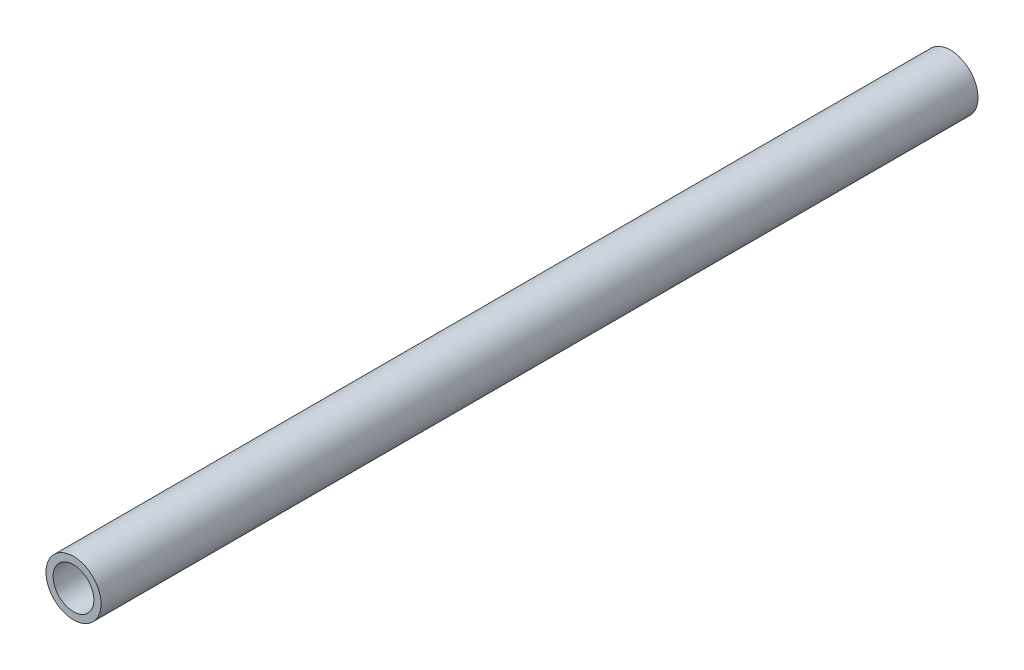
ISO-10303-21;
HEADER;
FILE_DESCRIPTION(('STEP AP214'),'2;1');
FILE_NAME('part.step','',(''),(''),'','','');
FILE_SCHEMA(('AUTOMOTIVE_DESIGN { 1 0 10303 214 1 1 1 1 }'));
ENDSEC;
DATA;
#1=APPLICATION_CONTEXT('core data for automotive mechanical design processes');
#2=APPLICATION_PROTOCOL_DEFINITION('international standard','automotive_design',2000,#1);
#3=PRODUCT_CONTEXT('',#1,'mechanical');
#4=PRODUCT('Part','Part','',(#3));
#5=PRODUCT_RELATED_PRODUCT_CATEGORY('part','',(#4));
#6=PRODUCT_DEFINITION_FORMATION('','',#4);
#7=PRODUCT_DEFINITION_CONTEXT('part definition',#1,'design');
#8=PRODUCT_DEFINITION('design','',#6,#7);
#9=PRODUCT_DEFINITION_SHAPE('','',#8);
#10=(LENGTH_UNIT() NAMED_UNIT(*) SI_UNIT(.MILLI.,.METRE.));
#11=(NAMED_UNIT(*) PLANE_ANGLE_UNIT() SI_UNIT($,.RADIAN.));
#12=(NAMED_UNIT(*) SI_UNIT($,.STERADIAN.) SOLID_ANGLE_UNIT());
#13=UNCERTAINTY_MEASURE_WITH_UNIT(LENGTH_MEASURE(1.E-05),#10,'distance_accuracy_value','');
#14=(GEOMETRIC_REPRESENTATION_CONTEXT(3) GLOBAL_UNCERTAINTY_ASSIGNED_CONTEXT((#13)) GLOBAL_UNIT_ASSIGNED_CONTEXT((#10,
#11,#12)) REPRESENTATION_CONTEXT('',''));
#15=CARTESIAN_POINT('',(0.,0.,0.));
#16=DIRECTION('',(0.,0.,1.));
#17=DIRECTION('',(1.,0.,0.));
#18=AXIS2_PLACEMENT_3D('',#15,#16,#17);
#19=CARTESIAN_POINT('',(0.,0.,273.05));
#20=DIRECTION('',(0.,0.,1.));
#21=DIRECTION('',(1.,0.,0.));
#22=AXIS2_PLACEMENT_3D('',#19,#20,#21);
#23=PLANE('',#22);
#24=CARTESIAN_POINT('',(0.,0.,273.05));
#25=DIRECTION('',(0.,0.,1.));
#26=DIRECTION('',(1.,0.,0.));
#27=AXIS2_PLACEMENT_3D('',#24,#25,#26);
#28=CIRCLE('',#27,8.5725);
#29=CARTESIAN_POINT('',(8.5725,0.,273.05));
#30=VERTEX_POINT('',#29);
#31=EDGE_CURVE('E12',#30,#30,#28,.T.);
#32=ORIENTED_EDGE('',*,*,#31,.T.);
#33=EDGE_LOOP('',(#32));
#34=FACE_BOUND('',#33,.T.);
#35=CARTESIAN_POINT('',(0.,0.,273.05));
#36=DIRECTION('',(0.,0.,1.));
#37=DIRECTION('',(1.,0.,0.));
#38=AXIS2_PLACEMENT_3D('',#35,#36,#37);
#39=CIRCLE('',#38,6.35);
#40=CARTESIAN_POINT('',(6.35,0.,273.05));
#41=VERTEX_POINT('',#40);
#42=EDGE_CURVE('E55',#41,#41,#39,.T.);
#43=ORIENTED_EDGE('',*,*,#42,.F.);
#44=EDGE_LOOP('',(#43));
#45=FACE_BOUND('',#44,.T.);
#46=ADVANCED_FACE('F44',(#34,#45),#23,.T.);
#47=CARTESIAN_POINT('',(0.,0.,0.));
#48=DIRECTION('',(0.,0.,1.));
#49=DIRECTION('',(1.,0.,0.));
#50=AXIS2_PLACEMENT_3D('',#47,#48,#49);
#51=PLANE('',#50);
#52=CARTESIAN_POINT('',(0.,0.,0.));
#53=DIRECTION('',(0.,0.,1.));
#54=DIRECTION('',(1.,0.,0.));
#55=AXIS2_PLACEMENT_3D('',#52,#53,#54);
#56=CIRCLE('',#55,8.5725);
#57=CARTESIAN_POINT('',(8.5725,0.,0.));
#58=VERTEX_POINT('',#57);
#59=EDGE_CURVE('E48',#58,#58,#56,.T.);
#60=ORIENTED_EDGE('',*,*,#59,.F.);
#61=EDGE_LOOP('',(#60));
#62=FACE_BOUND('',#61,.T.);
#63=CARTESIAN_POINT('',(0.,0.,0.));
#64=DIRECTION('',(0.,0.,1.));
#65=DIRECTION('',(1.,0.,0.));
#66=AXIS2_PLACEMENT_3D('',#63,#64,#65);
#67=CIRCLE('',#66,6.35);
#68=CARTESIAN_POINT('',(6.35,0.,0.));
#69=VERTEX_POINT('',#68);
#70=EDGE_CURVE('E57',#69,#69,#67,.T.);
#71=ORIENTED_EDGE('',*,*,#70,.T.);
#72=EDGE_LOOP('',(#71));
#73=FACE_BOUND('',#72,.T.);
#74=ADVANCED_FACE('F67',(#62,#73),#51,.F.);
#75=CARTESIAN_POINT('',(0.,0.,273.05));
#76=DIRECTION('',(0.,0.,-1.));
#77=DIRECTION('',(-1.,0.,0.));
#78=AXIS2_PLACEMENT_3D('',#75,#76,#77);
#79=CYLINDRICAL_SURFACE('',#78,8.5725);
#80=ORIENTED_EDGE('',*,*,#31,.F.);
#81=EDGE_LOOP('',(#80));
#82=FACE_BOUND('',#81,.T.);
#83=ORIENTED_EDGE('',*,*,#59,.T.);
#84=EDGE_LOOP('',(#83));
#85=FACE_BOUND('',#84,.T.);
#86=ADVANCED_FACE('F46',(#82,#85),#79,.T.);
#87=CARTESIAN_POINT('',(0.,0.,273.05));
#88=DIRECTION('',(0.,0.,-1.));
#89=DIRECTION('',(-1.,0.,0.));
#90=AXIS2_PLACEMENT_3D('',#87,#88,#89);
#91=CYLINDRICAL_SURFACE('',#90,6.35);
#92=ORIENTED_EDGE('',*,*,#42,.T.);
#93=EDGE_LOOP('',(#92));
#94=FACE_BOUND('',#93,.T.);
#95=ORIENTED_EDGE('',*,*,#70,.F.);
#96=EDGE_LOOP('',(#95));
#97=FACE_BOUND('',#96,.T.);
#98=ADVANCED_FACE('F63',(#94,#97),#91,.F.);
#99=CLOSED_SHELL('',(#46,#74,#86,#98));
#100=MANIFOLD_SOLID_BREP('B2',#99);
#101=ADVANCED_BREP_SHAPE_REPRESENTATION('',(#18,#100),#14);
#102=SHAPE_DEFINITION_REPRESENTATION(#9,#101);
ENDSEC;
END-ISO-10303-21;
